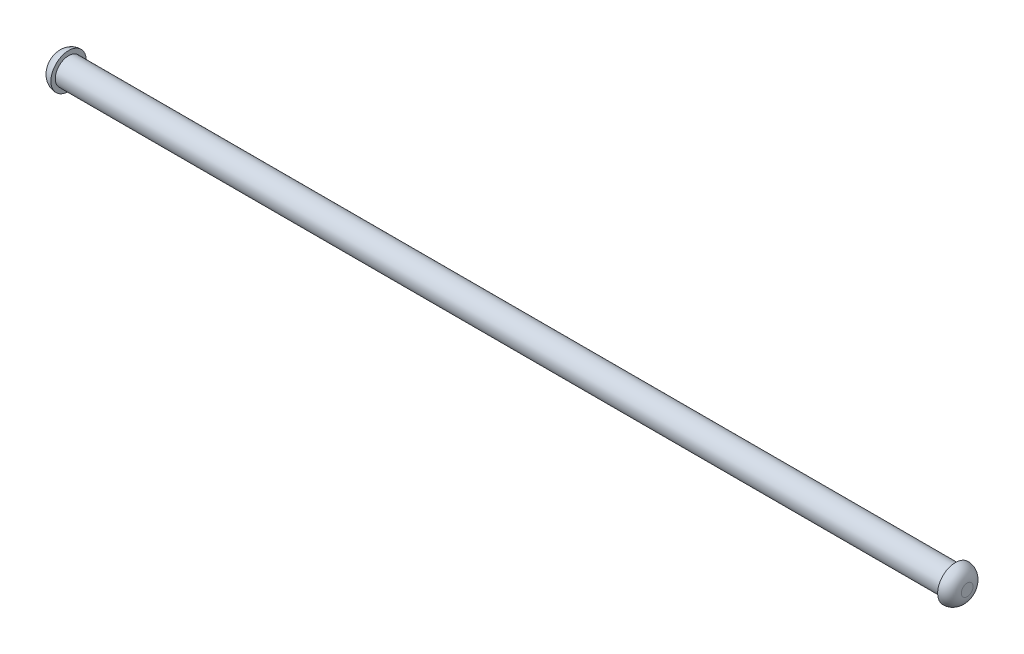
ISO-10303-21;
HEADER;
FILE_DESCRIPTION(('STEP AP214'),'2;1');
FILE_NAME('part.step','',(''),(''),'','','');
FILE_SCHEMA(('AUTOMOTIVE_DESIGN { 1 0 10303 214 1 1 1 1 }'));
ENDSEC;
DATA;
#1=APPLICATION_CONTEXT('core data for automotive mechanical design processes');
#2=APPLICATION_PROTOCOL_DEFINITION('international standard','automotive_design',2000,#1);
#3=PRODUCT_CONTEXT('',#1,'mechanical');
#4=PRODUCT('Part','Part','',(#3));
#5=PRODUCT_RELATED_PRODUCT_CATEGORY('part','',(#4));
#6=PRODUCT_DEFINITION_FORMATION('','',#4);
#7=PRODUCT_DEFINITION_CONTEXT('part definition',#1,'design');
#8=PRODUCT_DEFINITION('design','',#6,#7);
#9=PRODUCT_DEFINITION_SHAPE('','',#8);
#10=(LENGTH_UNIT() NAMED_UNIT(*) SI_UNIT(.MILLI.,.METRE.));
#11=(NAMED_UNIT(*) PLANE_ANGLE_UNIT() SI_UNIT($,.RADIAN.));
#12=(NAMED_UNIT(*) SI_UNIT($,.STERADIAN.) SOLID_ANGLE_UNIT());
#13=UNCERTAINTY_MEASURE_WITH_UNIT(LENGTH_MEASURE(1.E-05),#10,'distance_accuracy_value','');
#14=(GEOMETRIC_REPRESENTATION_CONTEXT(3) GLOBAL_UNCERTAINTY_ASSIGNED_CONTEXT((#13)) GLOBAL_UNIT_ASSIGNED_CONTEXT((#10,
#11,#12)) REPRESENTATION_CONTEXT('',''));
#15=CARTESIAN_POINT('',(0.,0.,0.));
#16=DIRECTION('',(0.,0.,1.));
#17=DIRECTION('',(1.,0.,0.));
#18=AXIS2_PLACEMENT_3D('',#15,#16,#17);
#19=CARTESIAN_POINT('',(750.,7.15135594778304,1.26231022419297));
#20=DIRECTION('',(-1.,0.,0.));
#21=DIRECTION('',(0.,0.,1.));
#22=AXIS2_PLACEMENT_3D('',#19,#20,#21);
#23=CYLINDRICAL_SURFACE('',#22,11.25);
#24=CARTESIAN_POINT('',(750.,7.15135594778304,1.26231022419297));
#25=DIRECTION('',(1.,0.,0.));
#26=DIRECTION('',(0.,0.,-1.));
#27=AXIS2_PLACEMENT_3D('',#24,#25,#26);
#28=CIRCLE('',#27,11.25);
#29=CARTESIAN_POINT('',(750.,7.15135594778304,-9.98768977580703));
#30=VERTEX_POINT('',#29);
#31=EDGE_CURVE('E50',#30,#30,#28,.T.);
#32=ORIENTED_EDGE('',*,*,#31,.F.);
#33=EDGE_LOOP('',(#32));
#34=FACE_BOUND('',#33,.T.);
#35=CARTESIAN_POINT('',(0.,7.15135594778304,1.26231022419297));
#36=DIRECTION('',(1.,0.,0.));
#37=DIRECTION('',(0.,0.,-1.));
#38=AXIS2_PLACEMENT_3D('',#35,#36,#37);
#39=CIRCLE('',#38,11.25);
#40=CARTESIAN_POINT('',(0.,7.15135594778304,-9.98768977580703));
#41=VERTEX_POINT('',#40);
#42=EDGE_CURVE('E58',#41,#41,#39,.T.);
#43=ORIENTED_EDGE('',*,*,#42,.T.);
#44=EDGE_LOOP('',(#43));
#45=FACE_BOUND('',#44,.T.);
#46=ADVANCED_FACE('F37',(#34,#45),#23,.T.);
#47=CARTESIAN_POINT('',(760.,7.15135594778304,1.26231022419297));
#48=DIRECTION('',(1.,0.,0.));
#49=DIRECTION('',(0.,0.,-1.));
#50=AXIS2_PLACEMENT_3D('',#47,#48,#49);
#51=PLANE('',#50);
#52=CARTESIAN_POINT('',(760.,7.15135594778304,1.26231022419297));
#53=DIRECTION('',(1.,0.,0.));
#54=DIRECTION('',(0.,0.,-1.));
#55=AXIS2_PLACEMENT_3D('',#52,#53,#54);
#56=CIRCLE('',#55,5.);
#57=CARTESIAN_POINT('',(760.,7.15135594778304,-3.73768977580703));
#58=VERTEX_POINT('',#57);
#59=EDGE_CURVE('E45',#58,#58,#56,.T.);
#60=ORIENTED_EDGE('',*,*,#59,.T.);
#61=EDGE_LOOP('',(#60));
#62=FACE_BOUND('',#61,.T.);
#63=ADVANCED_FACE('F86',(#62),#51,.T.);
#64=CARTESIAN_POINT('',(750.,7.15135594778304,1.26231022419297));
#65=DIRECTION('',(1.,0.,0.));
#66=DIRECTION('',(0.,0.,-1.));
#67=AXIS2_PLACEMENT_3D('',#64,#65,#66);
#68=PLANE('',#67);
#69=ORIENTED_EDGE('',*,*,#31,.T.);
#70=EDGE_LOOP('',(#69));
#71=FACE_BOUND('',#70,.T.);
#72=CARTESIAN_POINT('',(750.,7.15135594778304,1.26231022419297));
#73=DIRECTION('',(1.,0.,0.));
#74=DIRECTION('',(0.,0.,-1.));
#75=AXIS2_PLACEMENT_3D('',#72,#73,#74);
#76=CIRCLE('',#75,15.);
#77=CARTESIAN_POINT('',(750.,7.15135594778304,-13.737689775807));
#78=VERTEX_POINT('',#77);
#79=EDGE_CURVE('E55',#78,#78,#76,.T.);
#80=ORIENTED_EDGE('',*,*,#79,.F.);
#81=EDGE_LOOP('',(#80));
#82=FACE_BOUND('',#81,.T.);
#83=ADVANCED_FACE('F92',(#71,#82),#68,.F.);
#84=CARTESIAN_POINT('',(750.,7.15135594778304,1.26231022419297));
#85=DIRECTION('',(1.,0.,0.));
#86=DIRECTION('',(0.,0.,-1.));
#87=AXIS2_PLACEMENT_3D('',#84,#85,#86);
#88=DEGENERATE_TOROIDAL_SURFACE('',#87,5.,10.,.T.);
#89=ORIENTED_EDGE('',*,*,#79,.T.);
#90=EDGE_LOOP('',(#89));
#91=FACE_BOUND('',#90,.T.);
#92=ORIENTED_EDGE('',*,*,#59,.F.);
#93=EDGE_LOOP('',(#92));
#94=FACE_BOUND('',#93,.T.);
#95=ADVANCED_FACE('F81',(#91,#94),#88,.T.);
#96=CARTESIAN_POINT('',(-10.,7.20632170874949,1.25279563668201));
#97=DIRECTION('',(-1.,0.,0.));
#98=DIRECTION('',(0.,0.,1.));
#99=AXIS2_PLACEMENT_3D('',#96,#97,#98);
#100=PLANE('',#99);
#101=CARTESIAN_POINT('',(-10.,7.20632170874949,1.25279563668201));
#102=DIRECTION('',(-1.,0.,0.));
#103=DIRECTION('',(0.,0.,1.));
#104=AXIS2_PLACEMENT_3D('',#101,#102,#103);
#105=CIRCLE('',#104,5.);
#106=CARTESIAN_POINT('',(-10.,7.20632170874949,6.25279563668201));
#107=VERTEX_POINT('',#106);
#108=EDGE_CURVE('E10',#107,#107,#105,.T.);
#109=ORIENTED_EDGE('',*,*,#108,.T.);
#110=EDGE_LOOP('',(#109));
#111=FACE_BOUND('',#110,.T.);
#112=ADVANCED_FACE('F74',(#111),#100,.T.);
#113=CARTESIAN_POINT('',(0.,7.20632170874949,1.25279563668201));
#114=DIRECTION('',(-1.,0.,0.));
#115=DIRECTION('',(0.,0.,1.));
#116=AXIS2_PLACEMENT_3D('',#113,#114,#115);
#117=PLANE('',#116);
#118=ORIENTED_EDGE('',*,*,#42,.F.);
#119=EDGE_LOOP('',(#118));
#120=FACE_BOUND('',#119,.T.);
#121=CARTESIAN_POINT('',(0.,7.20632170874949,1.25279563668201));
#122=DIRECTION('',(-1.,0.,0.));
#123=DIRECTION('',(0.,0.,1.));
#124=AXIS2_PLACEMENT_3D('',#121,#122,#123);
#125=CIRCLE('',#124,15.);
#126=CARTESIAN_POINT('',(0.,7.20632170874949,16.252795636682));
#127=VERTEX_POINT('',#126);
#128=EDGE_CURVE('E61',#127,#127,#125,.T.);
#129=ORIENTED_EDGE('',*,*,#128,.F.);
#130=EDGE_LOOP('',(#129));
#131=FACE_BOUND('',#130,.T.);
#132=ADVANCED_FACE('F72',(#120,#131),#117,.F.);
#133=CARTESIAN_POINT('',(0.,7.20632170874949,1.25279563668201));
#134=DIRECTION('',(-1.,0.,0.));
#135=DIRECTION('',(0.,0.,1.));
#136=AXIS2_PLACEMENT_3D('',#133,#134,#135);
#137=DEGENERATE_TOROIDAL_SURFACE('',#136,5.,10.,.T.);
#138=ORIENTED_EDGE('',*,*,#128,.T.);
#139=EDGE_LOOP('',(#138));
#140=FACE_BOUND('',#139,.T.);
#141=ORIENTED_EDGE('',*,*,#108,.F.);
#142=EDGE_LOOP('',(#141));
#143=FACE_BOUND('',#142,.T.);
#144=ADVANCED_FACE('F39',(#140,#143),#137,.T.);
#145=CLOSED_SHELL('',(#46,#63,#83,#95,#112,#132,#144));
#146=MANIFOLD_SOLID_BREP('B2',#145);
#147=ADVANCED_BREP_SHAPE_REPRESENTATION('',(#18,#146),#14);
#148=SHAPE_DEFINITION_REPRESENTATION(#9,#147);
ENDSEC;
END-ISO-10303-21;
